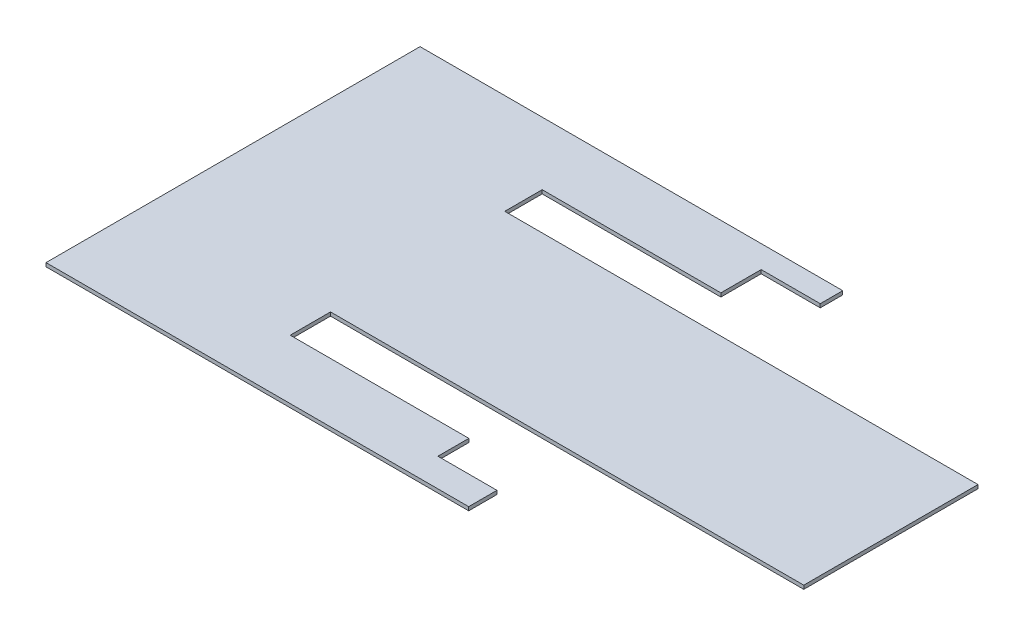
ISO-10303-21;
HEADER;
FILE_DESCRIPTION(('STEP AP214'),'2;1');
FILE_NAME('part.step','',(''),(''),'','','');
FILE_SCHEMA(('AUTOMOTIVE_DESIGN { 1 0 10303 214 1 1 1 1 }'));
ENDSEC;
DATA;
#1=APPLICATION_CONTEXT('core data for automotive mechanical design processes');
#2=APPLICATION_PROTOCOL_DEFINITION('international standard','automotive_design',2000,#1);
#3=PRODUCT_CONTEXT('',#1,'mechanical');
#4=PRODUCT('Part','Part','',(#3));
#5=PRODUCT_RELATED_PRODUCT_CATEGORY('part','',(#4));
#6=PRODUCT_DEFINITION_FORMATION('','',#4);
#7=PRODUCT_DEFINITION_CONTEXT('part definition',#1,'design');
#8=PRODUCT_DEFINITION('design','',#6,#7);
#9=PRODUCT_DEFINITION_SHAPE('','',#8);
#10=(LENGTH_UNIT() NAMED_UNIT(*) SI_UNIT(.MILLI.,.METRE.));
#11=(NAMED_UNIT(*) PLANE_ANGLE_UNIT() SI_UNIT($,.RADIAN.));
#12=(NAMED_UNIT(*) SI_UNIT($,.STERADIAN.) SOLID_ANGLE_UNIT());
#13=UNCERTAINTY_MEASURE_WITH_UNIT(LENGTH_MEASURE(1.E-05),#10,'distance_accuracy_value','');
#14=(GEOMETRIC_REPRESENTATION_CONTEXT(3) GLOBAL_UNCERTAINTY_ASSIGNED_CONTEXT((#13)) GLOBAL_UNIT_ASSIGNED_CONTEXT((#10,
#11,#12)) REPRESENTATION_CONTEXT('',''));
#15=CARTESIAN_POINT('',(0.,0.,0.));
#16=DIRECTION('',(0.,0.,1.));
#17=DIRECTION('',(1.,0.,0.));
#18=AXIS2_PLACEMENT_3D('',#15,#16,#17);
#19=CARTESIAN_POINT('',(105.959368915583,1.,41.4697311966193));
#20=DIRECTION('',(0.,-1.,0.));
#21=DIRECTION('',(0.,0.,-1.));
#22=AXIS2_PLACEMENT_3D('',#19,#20,#21);
#23=PLANE('',#22);
#24=DIRECTION('',(1.,0.,0.));
#25=VECTOR('',#24,1.);
#26=CARTESIAN_POINT('',(41.0652591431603,1.00000000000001,22.0110102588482));
#27=LINE('',#26,#25);
#28=CARTESIAN_POINT('',(41.0652591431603,1.,22.0110102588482));
#29=VERTEX_POINT('',#28);
#30=CARTESIAN_POINT('',(170.252319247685,0.999999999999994,22.0110102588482));
#31=VERTEX_POINT('',#30);
#32=EDGE_CURVE('E46',#29,#31,#27,.T.);
#33=ORIENTED_EDGE('',*,*,#32,.T.);
#34=DIRECTION('',(0.,0.,-1.));
#35=VECTOR('',#34,1.);
#36=CARTESIAN_POINT('',(170.252319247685,0.999999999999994,22.0110102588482));
#37=LINE('',#36,#35);
#38=CARTESIAN_POINT('',(170.252319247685,0.999999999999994,-25.5547520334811));
#39=VERTEX_POINT('',#38);
#40=EDGE_CURVE('E273',#31,#39,#37,.T.);
#41=ORIENTED_EDGE('',*,*,#40,.T.);
#42=DIRECTION('',(-1.,0.,0.));
#43=VECTOR('',#42,1.);
#44=CARTESIAN_POINT('',(115.388085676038,1.,-25.5547520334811));
#45=LINE('',#44,#43);
#46=CARTESIAN_POINT('',(41.0652591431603,1.,-25.5547520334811));
#47=VERTEX_POINT('',#46);
#48=EDGE_CURVE('E12',#39,#47,#45,.T.);
#49=ORIENTED_EDGE('',*,*,#48,.T.);
#50=DIRECTION('',(0.,0.,-1.));
#51=VECTOR('',#50,1.);
#52=CARTESIAN_POINT('',(41.0652591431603,1.,-25.5547520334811));
#53=LINE('',#52,#51);
#54=CARTESIAN_POINT('',(41.0652591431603,1.,-35.7754943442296));
#55=VERTEX_POINT('',#54);
#56=EDGE_CURVE('E212',#47,#55,#53,.T.);
#57=ORIENTED_EDGE('',*,*,#56,.T.);
#58=DIRECTION('',(1.,0.,0.));
#59=VECTOR('',#58,1.);
#60=CARTESIAN_POINT('',(41.0652591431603,1.,-35.7754943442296));
#61=LINE('',#60,#59);
#62=CARTESIAN_POINT('',(89.8362298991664,1.,-35.7754943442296));
#63=VERTEX_POINT('',#62);
#64=EDGE_CURVE('E210',#55,#63,#61,.T.);
#65=ORIENTED_EDGE('',*,*,#64,.T.);
#66=DIRECTION('',(0.,0.,-1.));
#67=VECTOR('',#66,1.);
#68=CARTESIAN_POINT('',(89.8362298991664,1.,-35.7754943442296));
#69=LINE('',#68,#67);
#70=CARTESIAN_POINT('',(89.8362298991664,1.,-46.7824476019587));
#71=VERTEX_POINT('',#70);
#72=EDGE_CURVE('E208',#63,#71,#69,.T.);
#73=ORIENTED_EDGE('',*,*,#72,.T.);
#74=DIRECTION('',(1.,0.,0.));
#75=VECTOR('',#74,1.);
#76=CARTESIAN_POINT('',(89.8362298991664,1.,-46.7824476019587));
#77=LINE('',#76,#75);
#78=CARTESIAN_POINT('',(105.959368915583,1.,-46.7824476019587));
#79=VERTEX_POINT('',#78);
#80=EDGE_CURVE('E206',#71,#79,#77,.T.);
#81=ORIENTED_EDGE('',*,*,#80,.T.);
#82=DIRECTION('',(0.,0.,-1.));
#83=VECTOR('',#82,1.);
#84=CARTESIAN_POINT('',(105.959368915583,1.,-46.7824476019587));
#85=LINE('',#84,#83);
#86=CARTESIAN_POINT('',(105.959368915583,1.,-52.9251673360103));
#87=VERTEX_POINT('',#86);
#88=EDGE_CURVE('E204',#79,#87,#85,.T.);
#89=ORIENTED_EDGE('',*,*,#88,.T.);
#90=DIRECTION('',(-1.,0.,0.));
#91=VECTOR('',#90,1.);
#92=CARTESIAN_POINT('',(105.959368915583,1.,-52.9251673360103));
#93=LINE('',#92,#91);
#94=CARTESIAN_POINT('',(-9.4287167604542,1.,-52.9251673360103));
#95=VERTEX_POINT('',#94);
#96=EDGE_CURVE('E202',#87,#95,#93,.T.);
#97=ORIENTED_EDGE('',*,*,#96,.T.);
#98=DIRECTION('',(0.,0.,1.));
#99=VECTOR('',#98,1.);
#100=CARTESIAN_POINT('',(-9.4287167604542,1.,49.1848728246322));
#101=LINE('',#100,#99);
#102=CARTESIAN_POINT('',(-9.4287167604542,1.,49.1848728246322));
#103=VERTEX_POINT('',#102);
#104=EDGE_CURVE('E200',#95,#103,#101,.T.);
#105=ORIENTED_EDGE('',*,*,#104,.T.);
#106=DIRECTION('',(1.,0.,0.));
#107=VECTOR('',#106,1.);
#108=CARTESIAN_POINT('',(105.959368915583,1.,49.1848728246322));
#109=LINE('',#108,#107);
#110=CARTESIAN_POINT('',(105.959368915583,1.,49.1848728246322));
#111=VERTEX_POINT('',#110);
#112=EDGE_CURVE('E198',#103,#111,#109,.T.);
#113=ORIENTED_EDGE('',*,*,#112,.T.);
#114=DIRECTION('',(0.,0.,-1.));
#115=VECTOR('',#114,1.);
#116=CARTESIAN_POINT('',(105.959368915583,1.,49.1848728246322));
#117=LINE('',#116,#115);
#118=CARTESIAN_POINT('',(105.959368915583,1.,41.4697311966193));
#119=VERTEX_POINT('',#118);
#120=EDGE_CURVE('E195',#111,#119,#117,.T.);
#121=ORIENTED_EDGE('',*,*,#120,.T.);
#122=DIRECTION('',(-1.,0.,0.));
#123=VECTOR('',#122,1.);
#124=CARTESIAN_POINT('',(89.8362298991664,1.,41.4697311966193));
#125=LINE('',#124,#123);
#126=CARTESIAN_POINT('',(89.8362298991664,1.,41.4697311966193));
#127=VERTEX_POINT('',#126);
#128=EDGE_CURVE('E193',#119,#127,#125,.T.);
#129=ORIENTED_EDGE('',*,*,#128,.T.);
#130=DIRECTION('',(0.,0.,-1.));
#131=VECTOR('',#130,1.);
#132=CARTESIAN_POINT('',(89.8362298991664,1.,33.0179635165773));
#133=LINE('',#132,#131);
#134=CARTESIAN_POINT('',(89.8362298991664,1.,33.0179635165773));
#135=VERTEX_POINT('',#134);
#136=EDGE_CURVE('E191',#127,#135,#133,.T.);
#137=ORIENTED_EDGE('',*,*,#136,.T.);
#138=DIRECTION('',(-1.,0.,0.));
#139=VECTOR('',#138,1.);
#140=CARTESIAN_POINT('',(89.8362298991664,1.,33.0179635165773));
#141=LINE('',#140,#139);
#142=CARTESIAN_POINT('',(41.0652591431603,1.,33.0179635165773));
#143=VERTEX_POINT('',#142);
#144=EDGE_CURVE('E187',#135,#143,#141,.T.);
#145=ORIENTED_EDGE('',*,*,#144,.T.);
#146=DIRECTION('',(0.,0.,-1.));
#147=VECTOR('',#146,1.);
#148=CARTESIAN_POINT('',(41.0652591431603,1.,33.0179635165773));
#149=LINE('',#148,#147);
#150=EDGE_CURVE('E183',#143,#29,#149,.T.);
#151=ORIENTED_EDGE('',*,*,#150,.T.);
#152=EDGE_LOOP('',(#33,#41,#49,#57,#65,#73,#81,#89,#97,#105,#113,#121,#129,#137,#145,#151));
#153=FACE_BOUND('',#152,.T.);
#154=ADVANCED_FACE('F43',(#153),#23,.F.);
#155=CARTESIAN_POINT('',(115.388085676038,1.,-25.5547520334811));
#156=DIRECTION('',(0.,0.,1.));
#157=DIRECTION('',(1.,0.,0.));
#158=AXIS2_PLACEMENT_3D('',#155,#156,#157);
#159=PLANE('',#158);
#160=ORIENTED_EDGE('',*,*,#48,.F.);
#161=DIRECTION('',(0.,-1.,0.));
#162=VECTOR('',#161,1.);
#163=CARTESIAN_POINT('',(170.252319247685,0.999999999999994,-25.5547520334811));
#164=LINE('',#163,#162);
#165=CARTESIAN_POINT('',(170.252319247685,0.,-25.5547520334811));
#166=VERTEX_POINT('',#165);
#167=EDGE_CURVE('E173',#39,#166,#164,.T.);
#168=ORIENTED_EDGE('',*,*,#167,.T.);
#169=DIRECTION('',(-1.,0.,0.));
#170=VECTOR('',#169,1.);
#171=CARTESIAN_POINT('',(115.388085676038,0.,-25.5547520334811));
#172=LINE('',#171,#170);
#173=CARTESIAN_POINT('',(41.0652591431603,0.,-25.5547520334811));
#174=VERTEX_POINT('',#173);
#175=EDGE_CURVE('E172',#166,#174,#172,.T.);
#176=ORIENTED_EDGE('',*,*,#175,.T.);
#177=DIRECTION('',(0.,-1.,0.));
#178=VECTOR('',#177,1.);
#179=CARTESIAN_POINT('',(41.0652591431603,1.,-25.5547520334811));
#180=LINE('',#179,#178);
#181=EDGE_CURVE('E214',#47,#174,#180,.T.);
#182=ORIENTED_EDGE('',*,*,#181,.F.);
#183=EDGE_LOOP('',(#160,#168,#176,#182));
#184=FACE_BOUND('',#183,.T.);
#185=ADVANCED_FACE('F276',(#184),#159,.F.);
#186=CARTESIAN_POINT('',(41.0652591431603,1.00000000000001,22.0110102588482));
#187=DIRECTION('',(0.,0.,-1.));
#188=DIRECTION('',(-1.,0.,0.));
#189=AXIS2_PLACEMENT_3D('',#186,#187,#188);
#190=PLANE('',#189);
#191=DIRECTION('',(1.,0.,0.));
#192=VECTOR('',#191,1.);
#193=CARTESIAN_POINT('',(41.0652591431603,0.,22.0110102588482));
#194=LINE('',#193,#192);
#195=CARTESIAN_POINT('',(41.0652591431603,0.,22.0110102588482));
#196=VERTEX_POINT('',#195);
#197=CARTESIAN_POINT('',(170.252319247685,0.,22.0110102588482));
#198=VERTEX_POINT('',#197);
#199=EDGE_CURVE('E70',#196,#198,#194,.T.);
#200=ORIENTED_EDGE('',*,*,#199,.T.);
#201=DIRECTION('',(0.,-1.,0.));
#202=VECTOR('',#201,1.);
#203=CARTESIAN_POINT('',(170.252319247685,0.999999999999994,22.0110102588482));
#204=LINE('',#203,#202);
#205=EDGE_CURVE('E185',#31,#198,#204,.T.);
#206=ORIENTED_EDGE('',*,*,#205,.F.);
#207=ORIENTED_EDGE('',*,*,#32,.F.);
#208=DIRECTION('',(0.,-1.,0.));
#209=VECTOR('',#208,1.);
#210=CARTESIAN_POINT('',(41.0652591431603,1.,22.0110102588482));
#211=LINE('',#210,#209);
#212=EDGE_CURVE('E179',#29,#196,#211,.T.);
#213=ORIENTED_EDGE('',*,*,#212,.T.);
#214=EDGE_LOOP('',(#200,#206,#207,#213));
#215=FACE_BOUND('',#214,.T.);
#216=ADVANCED_FACE('F182',(#215),#190,.F.);
#217=CARTESIAN_POINT('',(105.959368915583,0.,41.4697311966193));
#218=DIRECTION('',(0.,-1.,0.));
#219=DIRECTION('',(0.,0.,-1.));
#220=AXIS2_PLACEMENT_3D('',#217,#218,#219);
#221=PLANE('',#220);
#222=ORIENTED_EDGE('',*,*,#175,.F.);
#223=DIRECTION('',(0.,0.,-1.));
#224=VECTOR('',#223,1.);
#225=CARTESIAN_POINT('',(170.252319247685,0.,22.0110102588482));
#226=LINE('',#225,#224);
#227=EDGE_CURVE('E171',#198,#166,#226,.T.);
#228=ORIENTED_EDGE('',*,*,#227,.F.);
#229=ORIENTED_EDGE('',*,*,#199,.F.);
#230=DIRECTION('',(0.,0.,-1.));
#231=VECTOR('',#230,1.);
#232=CARTESIAN_POINT('',(41.0652591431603,0.,33.0179635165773));
#233=LINE('',#232,#231);
#234=CARTESIAN_POINT('',(41.0652591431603,0.,33.0179635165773));
#235=VERTEX_POINT('',#234);
#236=EDGE_CURVE('E169',#235,#196,#233,.T.);
#237=ORIENTED_EDGE('',*,*,#236,.F.);
#238=DIRECTION('',(-1.,0.,0.));
#239=VECTOR('',#238,1.);
#240=CARTESIAN_POINT('',(89.8362298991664,0.,33.0179635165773));
#241=LINE('',#240,#239);
#242=CARTESIAN_POINT('',(89.8362298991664,0.,33.0179635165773));
#243=VERTEX_POINT('',#242);
#244=EDGE_CURVE('E163',#243,#235,#241,.T.);
#245=ORIENTED_EDGE('',*,*,#244,.F.);
#246=DIRECTION('',(0.,0.,-1.));
#247=VECTOR('',#246,1.);
#248=CARTESIAN_POINT('',(89.8362298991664,0.,33.0179635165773));
#249=LINE('',#248,#247);
#250=CARTESIAN_POINT('',(89.8362298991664,0.,41.4697311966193));
#251=VERTEX_POINT('',#250);
#252=EDGE_CURVE('E266',#251,#243,#249,.T.);
#253=ORIENTED_EDGE('',*,*,#252,.F.);
#254=DIRECTION('',(-1.,0.,0.));
#255=VECTOR('',#254,1.);
#256=CARTESIAN_POINT('',(89.8362298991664,0.,41.4697311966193));
#257=LINE('',#256,#255);
#258=CARTESIAN_POINT('',(105.959368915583,0.,41.4697311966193));
#259=VERTEX_POINT('',#258);
#260=EDGE_CURVE('E84',#259,#251,#257,.T.);
#261=ORIENTED_EDGE('',*,*,#260,.F.);
#262=DIRECTION('',(0.,0.,-1.));
#263=VECTOR('',#262,1.);
#264=CARTESIAN_POINT('',(105.959368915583,0.,49.1848728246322));
#265=LINE('',#264,#263);
#266=CARTESIAN_POINT('',(105.959368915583,0.,49.1848728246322));
#267=VERTEX_POINT('',#266);
#268=EDGE_CURVE('E257',#267,#259,#265,.T.);
#269=ORIENTED_EDGE('',*,*,#268,.F.);
#270=DIRECTION('',(1.,0.,0.));
#271=VECTOR('',#270,1.);
#272=CARTESIAN_POINT('',(105.959368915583,0.,49.1848728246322));
#273=LINE('',#272,#271);
#274=CARTESIAN_POINT('',(-9.4287167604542,0.,49.1848728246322));
#275=VERTEX_POINT('',#274);
#276=EDGE_CURVE('E252',#275,#267,#273,.T.);
#277=ORIENTED_EDGE('',*,*,#276,.F.);
#278=DIRECTION('',(0.,0.,1.));
#279=VECTOR('',#278,1.);
#280=CARTESIAN_POINT('',(-9.4287167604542,0.,49.1848728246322));
#281=LINE('',#280,#279);
#282=CARTESIAN_POINT('',(-9.4287167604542,0.,-52.9251673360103));
#283=VERTEX_POINT('',#282);
#284=EDGE_CURVE('E247',#283,#275,#281,.T.);
#285=ORIENTED_EDGE('',*,*,#284,.F.);
#286=DIRECTION('',(-1.,0.,0.));
#287=VECTOR('',#286,1.);
#288=CARTESIAN_POINT('',(105.959368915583,0.,-52.9251673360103));
#289=LINE('',#288,#287);
#290=CARTESIAN_POINT('',(105.959368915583,0.,-52.9251673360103));
#291=VERTEX_POINT('',#290);
#292=EDGE_CURVE('E242',#291,#283,#289,.T.);
#293=ORIENTED_EDGE('',*,*,#292,.F.);
#294=DIRECTION('',(0.,0.,-1.));
#295=VECTOR('',#294,1.);
#296=CARTESIAN_POINT('',(105.959368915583,0.,-46.7824476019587));
#297=LINE('',#296,#295);
#298=CARTESIAN_POINT('',(105.959368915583,0.,-46.7824476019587));
#299=VERTEX_POINT('',#298);
#300=EDGE_CURVE('E237',#299,#291,#297,.T.);
#301=ORIENTED_EDGE('',*,*,#300,.F.);
#302=DIRECTION('',(1.,0.,0.));
#303=VECTOR('',#302,1.);
#304=CARTESIAN_POINT('',(89.8362298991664,0.,-46.7824476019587));
#305=LINE('',#304,#303);
#306=CARTESIAN_POINT('',(89.8362298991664,0.,-46.7824476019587));
#307=VERTEX_POINT('',#306);
#308=EDGE_CURVE('E232',#307,#299,#305,.T.);
#309=ORIENTED_EDGE('',*,*,#308,.F.);
#310=DIRECTION('',(0.,0.,-1.));
#311=VECTOR('',#310,1.);
#312=CARTESIAN_POINT('',(89.8362298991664,0.,-35.7754943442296));
#313=LINE('',#312,#311);
#314=CARTESIAN_POINT('',(89.8362298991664,0.,-35.7754943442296));
#315=VERTEX_POINT('',#314);
#316=EDGE_CURVE('E227',#315,#307,#313,.T.);
#317=ORIENTED_EDGE('',*,*,#316,.F.);
#318=DIRECTION('',(1.,0.,0.));
#319=VECTOR('',#318,1.);
#320=CARTESIAN_POINT('',(41.0652591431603,0.,-35.7754943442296));
#321=LINE('',#320,#319);
#322=CARTESIAN_POINT('',(41.0652591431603,0.,-35.7754943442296));
#323=VERTEX_POINT('',#322);
#324=EDGE_CURVE('E222',#323,#315,#321,.T.);
#325=ORIENTED_EDGE('',*,*,#324,.F.);
#326=DIRECTION('',(0.,0.,-1.));
#327=VECTOR('',#326,1.);
#328=CARTESIAN_POINT('',(41.0652591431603,0.,-25.5547520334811));
#329=LINE('',#328,#327);
#330=EDGE_CURVE('E217',#174,#323,#329,.T.);
#331=ORIENTED_EDGE('',*,*,#330,.F.);
#332=EDGE_LOOP('',(#222,#228,#229,#237,#245,#253,#261,#269,#277,#285,#293,#301,#309,#317,#325,#331));
#333=FACE_BOUND('',#332,.T.);
#334=ADVANCED_FACE('F168',(#333),#221,.T.);
#335=CARTESIAN_POINT('',(170.252319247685,0.999999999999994,22.0110102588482));
#336=DIRECTION('',(-1.,0.,0.));
#337=DIRECTION('',(0.,0.,1.));
#338=AXIS2_PLACEMENT_3D('',#335,#336,#337);
#339=PLANE('',#338);
#340=ORIENTED_EDGE('',*,*,#227,.T.);
#341=ORIENTED_EDGE('',*,*,#167,.F.);
#342=ORIENTED_EDGE('',*,*,#40,.F.);
#343=ORIENTED_EDGE('',*,*,#205,.T.);
#344=EDGE_LOOP('',(#340,#341,#342,#343));
#345=FACE_BOUND('',#344,.T.);
#346=ADVANCED_FACE('F298',(#345),#339,.F.);
#347=CARTESIAN_POINT('',(41.0652591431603,1.,33.0179635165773));
#348=DIRECTION('',(-1.,0.,0.));
#349=DIRECTION('',(0.,0.,1.));
#350=AXIS2_PLACEMENT_3D('',#347,#348,#349);
#351=PLANE('',#350);
#352=ORIENTED_EDGE('',*,*,#236,.T.);
#353=ORIENTED_EDGE('',*,*,#212,.F.);
#354=ORIENTED_EDGE('',*,*,#150,.F.);
#355=DIRECTION('',(0.,-1.,0.));
#356=VECTOR('',#355,1.);
#357=CARTESIAN_POINT('',(41.0652591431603,1.,33.0179635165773));
#358=LINE('',#357,#356);
#359=EDGE_CURVE('E180',#143,#235,#358,.T.);
#360=ORIENTED_EDGE('',*,*,#359,.T.);
#361=EDGE_LOOP('',(#352,#353,#354,#360));
#362=FACE_BOUND('',#361,.T.);
#363=ADVANCED_FACE('F177',(#362),#351,.F.);
#364=CARTESIAN_POINT('',(89.8362298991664,1.,33.0179635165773));
#365=DIRECTION('',(0.,0.,1.));
#366=DIRECTION('',(1.,0.,0.));
#367=AXIS2_PLACEMENT_3D('',#364,#365,#366);
#368=PLANE('',#367);
#369=ORIENTED_EDGE('',*,*,#244,.T.);
#370=ORIENTED_EDGE('',*,*,#359,.F.);
#371=ORIENTED_EDGE('',*,*,#144,.F.);
#372=DIRECTION('',(0.,-1.,0.));
#373=VECTOR('',#372,1.);
#374=CARTESIAN_POINT('',(89.8362298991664,1.,33.0179635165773));
#375=LINE('',#374,#373);
#376=EDGE_CURVE('E268',#135,#243,#375,.T.);
#377=ORIENTED_EDGE('',*,*,#376,.T.);
#378=EDGE_LOOP('',(#369,#370,#371,#377));
#379=FACE_BOUND('',#378,.T.);
#380=ADVANCED_FACE('F305',(#379),#368,.F.);
#381=CARTESIAN_POINT('',(89.8362298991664,1.,33.0179635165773));
#382=DIRECTION('',(-1.,0.,0.));
#383=DIRECTION('',(0.,0.,1.));
#384=AXIS2_PLACEMENT_3D('',#381,#382,#383);
#385=PLANE('',#384);
#386=ORIENTED_EDGE('',*,*,#252,.T.);
#387=ORIENTED_EDGE('',*,*,#376,.F.);
#388=ORIENTED_EDGE('',*,*,#136,.F.);
#389=DIRECTION('',(0.,-1.,0.));
#390=VECTOR('',#389,1.);
#391=CARTESIAN_POINT('',(89.8362298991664,1.,41.4697311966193));
#392=LINE('',#391,#390);
#393=EDGE_CURVE('E263',#127,#251,#392,.T.);
#394=ORIENTED_EDGE('',*,*,#393,.T.);
#395=EDGE_LOOP('',(#386,#387,#388,#394));
#396=FACE_BOUND('',#395,.T.);
#397=ADVANCED_FACE('F345',(#396),#385,.F.);
#398=CARTESIAN_POINT('',(89.8362298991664,1.,41.4697311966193));
#399=DIRECTION('',(0.,0.,1.));
#400=DIRECTION('',(1.,0.,0.));
#401=AXIS2_PLACEMENT_3D('',#398,#399,#400);
#402=PLANE('',#401);
#403=ORIENTED_EDGE('',*,*,#260,.T.);
#404=ORIENTED_EDGE('',*,*,#393,.F.);
#405=ORIENTED_EDGE('',*,*,#128,.F.);
#406=DIRECTION('',(0.,-1.,0.));
#407=VECTOR('',#406,1.);
#408=CARTESIAN_POINT('',(105.959368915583,1.,41.4697311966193));
#409=LINE('',#408,#407);
#410=EDGE_CURVE('E260',#119,#259,#409,.T.);
#411=ORIENTED_EDGE('',*,*,#410,.T.);
#412=EDGE_LOOP('',(#403,#404,#405,#411));
#413=FACE_BOUND('',#412,.T.);
#414=ADVANCED_FACE('F354',(#413),#402,.F.);
#415=CARTESIAN_POINT('',(105.959368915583,1.,49.1848728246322));
#416=DIRECTION('',(-1.,0.,0.));
#417=DIRECTION('',(0.,0.,1.));
#418=AXIS2_PLACEMENT_3D('',#415,#416,#417);
#419=PLANE('',#418);
#420=ORIENTED_EDGE('',*,*,#268,.T.);
#421=ORIENTED_EDGE('',*,*,#410,.F.);
#422=ORIENTED_EDGE('',*,*,#120,.F.);
#423=DIRECTION('',(0.,-1.,0.));
#424=VECTOR('',#423,1.);
#425=CARTESIAN_POINT('',(105.959368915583,1.,49.1848728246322));
#426=LINE('',#425,#424);
#427=EDGE_CURVE('E254',#111,#267,#426,.T.);
#428=ORIENTED_EDGE('',*,*,#427,.T.);
#429=EDGE_LOOP('',(#420,#421,#422,#428));
#430=FACE_BOUND('',#429,.T.);
#431=ADVANCED_FACE('F364',(#430),#419,.F.);
#432=CARTESIAN_POINT('',(105.959368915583,1.,49.1848728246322));
#433=DIRECTION('',(0.,0.,-1.));
#434=DIRECTION('',(-1.,0.,0.));
#435=AXIS2_PLACEMENT_3D('',#432,#433,#434);
#436=PLANE('',#435);
#437=ORIENTED_EDGE('',*,*,#276,.T.);
#438=ORIENTED_EDGE('',*,*,#427,.F.);
#439=ORIENTED_EDGE('',*,*,#112,.F.);
#440=DIRECTION('',(0.,-1.,0.));
#441=VECTOR('',#440,1.);
#442=CARTESIAN_POINT('',(-9.4287167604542,1.,49.1848728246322));
#443=LINE('',#442,#441);
#444=EDGE_CURVE('E249',#103,#275,#443,.T.);
#445=ORIENTED_EDGE('',*,*,#444,.T.);
#446=EDGE_LOOP('',(#437,#438,#439,#445));
#447=FACE_BOUND('',#446,.T.);
#448=ADVANCED_FACE('F374',(#447),#436,.F.);
#449=CARTESIAN_POINT('',(-9.4287167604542,1.,49.1848728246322));
#450=DIRECTION('',(1.,0.,0.));
#451=DIRECTION('',(0.,0.,-1.));
#452=AXIS2_PLACEMENT_3D('',#449,#450,#451);
#453=PLANE('',#452);
#454=ORIENTED_EDGE('',*,*,#284,.T.);
#455=ORIENTED_EDGE('',*,*,#444,.F.);
#456=ORIENTED_EDGE('',*,*,#104,.F.);
#457=DIRECTION('',(0.,-1.,0.));
#458=VECTOR('',#457,1.);
#459=CARTESIAN_POINT('',(-9.4287167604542,1.,-52.9251673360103));
#460=LINE('',#459,#458);
#461=EDGE_CURVE('E244',#95,#283,#460,.T.);
#462=ORIENTED_EDGE('',*,*,#461,.T.);
#463=EDGE_LOOP('',(#454,#455,#456,#462));
#464=FACE_BOUND('',#463,.T.);
#465=ADVANCED_FACE('F384',(#464),#453,.F.);
#466=CARTESIAN_POINT('',(105.959368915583,1.,-52.9251673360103));
#467=DIRECTION('',(0.,0.,1.));
#468=DIRECTION('',(1.,0.,0.));
#469=AXIS2_PLACEMENT_3D('',#466,#467,#468);
#470=PLANE('',#469);
#471=ORIENTED_EDGE('',*,*,#292,.T.);
#472=ORIENTED_EDGE('',*,*,#461,.F.);
#473=ORIENTED_EDGE('',*,*,#96,.F.);
#474=DIRECTION('',(0.,-1.,0.));
#475=VECTOR('',#474,1.);
#476=CARTESIAN_POINT('',(105.959368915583,1.,-52.9251673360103));
#477=LINE('',#476,#475);
#478=EDGE_CURVE('E239',#87,#291,#477,.T.);
#479=ORIENTED_EDGE('',*,*,#478,.T.);
#480=EDGE_LOOP('',(#471,#472,#473,#479));
#481=FACE_BOUND('',#480,.T.);
#482=ADVANCED_FACE('F394',(#481),#470,.F.);
#483=CARTESIAN_POINT('',(105.959368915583,1.,-46.7824476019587));
#484=DIRECTION('',(-1.,0.,0.));
#485=DIRECTION('',(0.,0.,1.));
#486=AXIS2_PLACEMENT_3D('',#483,#484,#485);
#487=PLANE('',#486);
#488=ORIENTED_EDGE('',*,*,#300,.T.);
#489=ORIENTED_EDGE('',*,*,#478,.F.);
#490=ORIENTED_EDGE('',*,*,#88,.F.);
#491=DIRECTION('',(0.,-1.,0.));
#492=VECTOR('',#491,1.);
#493=CARTESIAN_POINT('',(105.959368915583,1.,-46.7824476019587));
#494=LINE('',#493,#492);
#495=EDGE_CURVE('E234',#79,#299,#494,.T.);
#496=ORIENTED_EDGE('',*,*,#495,.T.);
#497=EDGE_LOOP('',(#488,#489,#490,#496));
#498=FACE_BOUND('',#497,.T.);
#499=ADVANCED_FACE('F404',(#498),#487,.F.);
#500=CARTESIAN_POINT('',(89.8362298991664,1.,-46.7824476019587));
#501=DIRECTION('',(0.,0.,-1.));
#502=DIRECTION('',(-1.,0.,0.));
#503=AXIS2_PLACEMENT_3D('',#500,#501,#502);
#504=PLANE('',#503);
#505=ORIENTED_EDGE('',*,*,#308,.T.);
#506=ORIENTED_EDGE('',*,*,#495,.F.);
#507=ORIENTED_EDGE('',*,*,#80,.F.);
#508=DIRECTION('',(0.,-1.,0.));
#509=VECTOR('',#508,1.);
#510=CARTESIAN_POINT('',(89.8362298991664,1.,-46.7824476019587));
#511=LINE('',#510,#509);
#512=EDGE_CURVE('E229',#71,#307,#511,.T.);
#513=ORIENTED_EDGE('',*,*,#512,.T.);
#514=EDGE_LOOP('',(#505,#506,#507,#513));
#515=FACE_BOUND('',#514,.T.);
#516=ADVANCED_FACE('F414',(#515),#504,.F.);
#517=CARTESIAN_POINT('',(89.8362298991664,1.,-35.7754943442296));
#518=DIRECTION('',(-1.,0.,0.));
#519=DIRECTION('',(0.,0.,1.));
#520=AXIS2_PLACEMENT_3D('',#517,#518,#519);
#521=PLANE('',#520);
#522=ORIENTED_EDGE('',*,*,#316,.T.);
#523=ORIENTED_EDGE('',*,*,#512,.F.);
#524=ORIENTED_EDGE('',*,*,#72,.F.);
#525=DIRECTION('',(0.,-1.,0.));
#526=VECTOR('',#525,1.);
#527=CARTESIAN_POINT('',(89.8362298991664,1.,-35.7754943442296));
#528=LINE('',#527,#526);
#529=EDGE_CURVE('E224',#63,#315,#528,.T.);
#530=ORIENTED_EDGE('',*,*,#529,.T.);
#531=EDGE_LOOP('',(#522,#523,#524,#530));
#532=FACE_BOUND('',#531,.T.);
#533=ADVANCED_FACE('F292',(#532),#521,.F.);
#534=CARTESIAN_POINT('',(41.0652591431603,1.,-35.7754943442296));
#535=DIRECTION('',(0.,0.,-1.));
#536=DIRECTION('',(-1.,0.,0.));
#537=AXIS2_PLACEMENT_3D('',#534,#535,#536);
#538=PLANE('',#537);
#539=ORIENTED_EDGE('',*,*,#324,.T.);
#540=ORIENTED_EDGE('',*,*,#529,.F.);
#541=ORIENTED_EDGE('',*,*,#64,.F.);
#542=DIRECTION('',(0.,-1.,0.));
#543=VECTOR('',#542,1.);
#544=CARTESIAN_POINT('',(41.0652591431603,1.,-35.7754943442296));
#545=LINE('',#544,#543);
#546=EDGE_CURVE('E219',#55,#323,#545,.T.);
#547=ORIENTED_EDGE('',*,*,#546,.T.);
#548=EDGE_LOOP('',(#539,#540,#541,#547));
#549=FACE_BOUND('',#548,.T.);
#550=ADVANCED_FACE('F288',(#549),#538,.F.);
#551=CARTESIAN_POINT('',(41.0652591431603,1.,-25.5547520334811));
#552=DIRECTION('',(-1.,0.,0.));
#553=DIRECTION('',(0.,0.,1.));
#554=AXIS2_PLACEMENT_3D('',#551,#552,#553);
#555=PLANE('',#554);
#556=ORIENTED_EDGE('',*,*,#330,.T.);
#557=ORIENTED_EDGE('',*,*,#546,.F.);
#558=ORIENTED_EDGE('',*,*,#56,.F.);
#559=ORIENTED_EDGE('',*,*,#181,.T.);
#560=EDGE_LOOP('',(#556,#557,#558,#559));
#561=FACE_BOUND('',#560,.T.);
#562=ADVANCED_FACE('F281',(#561),#555,.F.);
#563=CLOSED_SHELL('',(#154,#185,#216,#334,#346,#363,#380,#397,#414,#431,#448,#465,#482,#499,
#516,#533,#550,#562));
#564=MANIFOLD_SOLID_BREP('B2',#563);
#565=ADVANCED_BREP_SHAPE_REPRESENTATION('',(#18,#564),#14);
#566=SHAPE_DEFINITION_REPRESENTATION(#9,#565);
ENDSEC;
END-ISO-10303-21;
